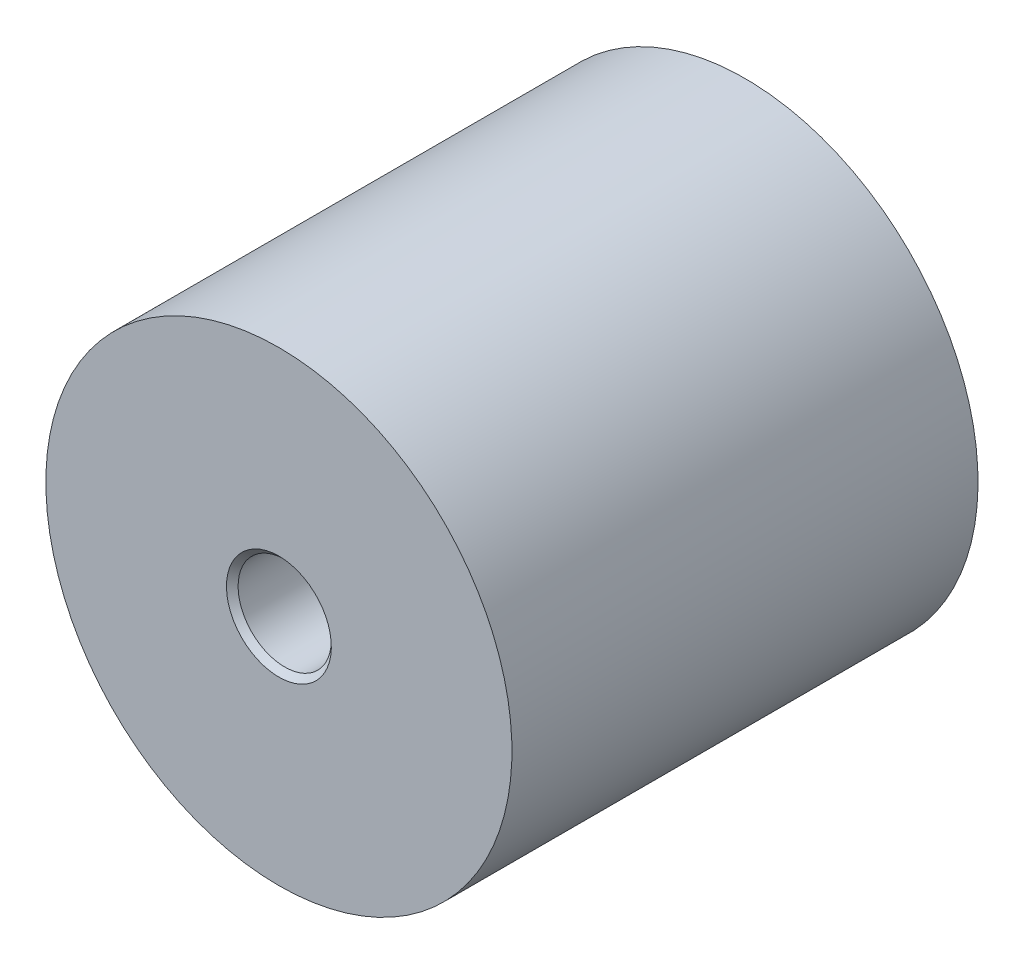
ISO-10303-21;
HEADER;
FILE_DESCRIPTION(('STEP AP214'),'2;1');
FILE_NAME('part.step','',(''),(''),'','','');
FILE_SCHEMA(('AUTOMOTIVE_DESIGN { 1 0 10303 214 1 1 1 1 }'));
ENDSEC;
DATA;
#1=APPLICATION_CONTEXT('core data for automotive mechanical design processes');
#2=APPLICATION_PROTOCOL_DEFINITION('international standard','automotive_design',2000,#1);
#3=PRODUCT_CONTEXT('',#1,'mechanical');
#4=PRODUCT('Part','Part','',(#3));
#5=PRODUCT_RELATED_PRODUCT_CATEGORY('part','',(#4));
#6=PRODUCT_DEFINITION_FORMATION('','',#4);
#7=PRODUCT_DEFINITION_CONTEXT('part definition',#1,'design');
#8=PRODUCT_DEFINITION('design','',#6,#7);
#9=PRODUCT_DEFINITION_SHAPE('','',#8);
#10=(LENGTH_UNIT() NAMED_UNIT(*) SI_UNIT(.MILLI.,.METRE.));
#11=(NAMED_UNIT(*) PLANE_ANGLE_UNIT() SI_UNIT($,.RADIAN.));
#12=(NAMED_UNIT(*) SI_UNIT($,.STERADIAN.) SOLID_ANGLE_UNIT());
#13=UNCERTAINTY_MEASURE_WITH_UNIT(LENGTH_MEASURE(1.E-05),#10,'distance_accuracy_value','');
#14=(GEOMETRIC_REPRESENTATION_CONTEXT(3) GLOBAL_UNCERTAINTY_ASSIGNED_CONTEXT((#13)) GLOBAL_UNIT_ASSIGNED_CONTEXT((#10,
#11,#12)) REPRESENTATION_CONTEXT('',''));
#15=CARTESIAN_POINT('',(0.,0.,0.));
#16=DIRECTION('',(0.,0.,1.));
#17=DIRECTION('',(1.,0.,0.));
#18=AXIS2_PLACEMENT_3D('',#15,#16,#17);
#19=CARTESIAN_POINT('',(0.,0.,1.));
#20=DIRECTION('',(0.,0.,1.));
#21=DIRECTION('',(0.,-1.,0.));
#22=AXIS2_PLACEMENT_3D('',#19,#20,#21);
#23=CYLINDRICAL_SURFACE('',#22,20.);
#24=CARTESIAN_POINT('',(0.,0.,0.));
#25=DIRECTION('',(0.,0.,1.));
#26=DIRECTION('',(0.,-1.,0.));
#27=AXIS2_PLACEMENT_3D('',#24,#25,#26);
#28=CIRCLE('',#27,20.);
#29=CARTESIAN_POINT('',(0.,-20.,0.));
#30=VERTEX_POINT('',#29);
#31=EDGE_CURVE('E23',#30,#30,#28,.T.);
#32=ORIENTED_EDGE('',*,*,#31,.T.);
#33=EDGE_LOOP('',(#32));
#34=FACE_BOUND('',#33,.T.);
#35=CARTESIAN_POINT('',(0.,0.,40.));
#36=DIRECTION('',(0.,0.,-1.));
#37=DIRECTION('',(0.,1.,0.));
#38=AXIS2_PLACEMENT_3D('',#35,#36,#37);
#39=CIRCLE('',#38,20.);
#40=CARTESIAN_POINT('',(0.,20.,40.));
#41=VERTEX_POINT('',#40);
#42=EDGE_CURVE('E32',#41,#41,#39,.T.);
#43=ORIENTED_EDGE('',*,*,#42,.T.);
#44=EDGE_LOOP('',(#43));
#45=FACE_BOUND('',#44,.T.);
#46=ADVANCED_FACE('F12',(#34,#45),#23,.T.);
#47=CARTESIAN_POINT('',(20.,0.,0.));
#48=DIRECTION('',(0.,0.,-1.));
#49=DIRECTION('',(0.,1.,0.));
#50=AXIS2_PLACEMENT_3D('',#47,#48,#49);
#51=PLANE('',#50);
#52=CARTESIAN_POINT('',(0.,0.,0.));
#53=DIRECTION('',(0.,0.,-1.));
#54=DIRECTION('',(0.,1.,0.));
#55=AXIS2_PLACEMENT_3D('',#52,#53,#54);
#56=CIRCLE('',#55,4.5);
#57=CARTESIAN_POINT('',(0.,4.5,0.));
#58=VERTEX_POINT('',#57);
#59=EDGE_CURVE('E8',#58,#58,#56,.F.);
#60=ORIENTED_EDGE('',*,*,#59,.T.);
#61=EDGE_LOOP('',(#60));
#62=FACE_BOUND('',#61,.T.);
#63=ORIENTED_EDGE('',*,*,#31,.F.);
#64=EDGE_LOOP('',(#63));
#65=FACE_BOUND('',#64,.T.);
#66=ADVANCED_FACE('F58',(#62,#65),#51,.T.);
#67=CARTESIAN_POINT('',(0.,0.,0.));
#68=DIRECTION('',(0.,0.,1.));
#69=DIRECTION('',(0.,-1.,0.));
#70=AXIS2_PLACEMENT_3D('',#67,#68,#69);
#71=CYLINDRICAL_SURFACE('',#70,4.);
#72=CARTESIAN_POINT('',(0.,0.,0.50000000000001));
#73=DIRECTION('',(0.,0.,-1.));
#74=DIRECTION('',(0.,1.,0.));
#75=AXIS2_PLACEMENT_3D('',#72,#73,#74);
#76=CIRCLE('',#75,4.);
#77=CARTESIAN_POINT('',(0.,4.,0.50000000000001));
#78=VERTEX_POINT('',#77);
#79=EDGE_CURVE('E19',#78,#78,#76,.T.);
#80=ORIENTED_EDGE('',*,*,#79,.T.);
#81=EDGE_LOOP('',(#80));
#82=FACE_BOUND('',#81,.T.);
#83=CARTESIAN_POINT('',(0.,0.,8.));
#84=DIRECTION('',(0.,0.,-1.));
#85=DIRECTION('',(0.,1.,0.));
#86=AXIS2_PLACEMENT_3D('',#83,#84,#85);
#87=CIRCLE('',#86,4.);
#88=CARTESIAN_POINT('',(0.,4.,8.));
#89=VERTEX_POINT('',#88);
#90=EDGE_CURVE('E27',#89,#89,#87,.T.);
#91=ORIENTED_EDGE('',*,*,#90,.F.);
#92=EDGE_LOOP('',(#91));
#93=FACE_BOUND('',#92,.T.);
#94=ADVANCED_FACE('F63',(#82,#93),#71,.F.);
#95=CARTESIAN_POINT('',(0.,0.,8.));
#96=DIRECTION('',(0.,0.,-1.));
#97=DIRECTION('',(0.,1.,0.));
#98=AXIS2_PLACEMENT_3D('',#95,#96,#97);
#99=PLANE('',#98);
#100=ORIENTED_EDGE('',*,*,#90,.T.);
#101=EDGE_LOOP('',(#100));
#102=FACE_BOUND('',#101,.T.);
#103=ADVANCED_FACE('F69',(#102),#99,.T.);
#104=CARTESIAN_POINT('',(0.,0.,0.50000000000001));
#105=DIRECTION('',(0.,0.,-1.));
#106=DIRECTION('',(0.,1.,0.));
#107=AXIS2_PLACEMENT_3D('',#104,#105,#106);
#108=CONICAL_SURFACE('',#107,4.,0.785398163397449);
#109=ORIENTED_EDGE('',*,*,#59,.F.);
#110=EDGE_LOOP('',(#109));
#111=FACE_BOUND('',#110,.T.);
#112=ORIENTED_EDGE('',*,*,#79,.F.);
#113=EDGE_LOOP('',(#112));
#114=FACE_BOUND('',#113,.T.);
#115=ADVANCED_FACE('F14',(#111,#114),#108,.F.);
#116=CARTESIAN_POINT('',(20.,0.,40.));
#117=DIRECTION('',(0.,0.,1.));
#118=DIRECTION('',(0.,-1.,0.));
#119=AXIS2_PLACEMENT_3D('',#116,#117,#118);
#120=PLANE('',#119);
#121=CARTESIAN_POINT('',(0.,0.,40.));
#122=DIRECTION('',(0.,0.,-1.));
#123=DIRECTION('',(0.,1.,0.));
#124=AXIS2_PLACEMENT_3D('',#121,#122,#123);
#125=CIRCLE('',#124,4.5);
#126=CARTESIAN_POINT('',(0.,4.5,40.));
#127=VERTEX_POINT('',#126);
#128=EDGE_CURVE('E35',#127,#127,#125,.T.);
#129=ORIENTED_EDGE('',*,*,#128,.T.);
#130=EDGE_LOOP('',(#129));
#131=FACE_BOUND('',#130,.T.);
#132=ORIENTED_EDGE('',*,*,#42,.F.);
#133=EDGE_LOOP('',(#132));
#134=FACE_BOUND('',#133,.T.);
#135=ADVANCED_FACE('F73',(#131,#134),#120,.T.);
#136=CARTESIAN_POINT('',(0.,0.,40.));
#137=DIRECTION('',(0.,0.,1.));
#138=DIRECTION('',(0.,-1.,0.));
#139=AXIS2_PLACEMENT_3D('',#136,#137,#138);
#140=CONICAL_SURFACE('',#139,4.5,0.785398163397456);
#141=CARTESIAN_POINT('',(0.,0.,39.5));
#142=DIRECTION('',(0.,0.,-1.));
#143=DIRECTION('',(0.,1.,0.));
#144=AXIS2_PLACEMENT_3D('',#141,#142,#143);
#145=CIRCLE('',#144,4.);
#146=CARTESIAN_POINT('',(0.,4.,39.5));
#147=VERTEX_POINT('',#146);
#148=EDGE_CURVE('E38',#147,#147,#145,.T.);
#149=ORIENTED_EDGE('',*,*,#148,.T.);
#150=EDGE_LOOP('',(#149));
#151=FACE_BOUND('',#150,.T.);
#152=ORIENTED_EDGE('',*,*,#128,.F.);
#153=EDGE_LOOP('',(#152));
#154=FACE_BOUND('',#153,.T.);
#155=ADVANCED_FACE('F55',(#151,#154),#140,.F.);
#156=CARTESIAN_POINT('',(0.,0.,0.));
#157=DIRECTION('',(0.,0.,-1.));
#158=DIRECTION('',(0.,1.,0.));
#159=AXIS2_PLACEMENT_3D('',#156,#157,#158);
#160=CYLINDRICAL_SURFACE('',#159,4.);
#161=CARTESIAN_POINT('',(0.,0.,32.));
#162=DIRECTION('',(0.,0.,-1.));
#163=DIRECTION('',(0.,1.,0.));
#164=AXIS2_PLACEMENT_3D('',#161,#162,#163);
#165=CIRCLE('',#164,4.);
#166=CARTESIAN_POINT('',(0.,4.,32.));
#167=VERTEX_POINT('',#166);
#168=EDGE_CURVE('E41',#167,#167,#165,.T.);
#169=ORIENTED_EDGE('',*,*,#168,.T.);
#170=EDGE_LOOP('',(#169));
#171=FACE_BOUND('',#170,.T.);
#172=ORIENTED_EDGE('',*,*,#148,.F.);
#173=EDGE_LOOP('',(#172));
#174=FACE_BOUND('',#173,.T.);
#175=ADVANCED_FACE('F45',(#171,#174),#160,.F.);
#176=CARTESIAN_POINT('',(4.,0.,32.));
#177=DIRECTION('',(0.,0.,1.));
#178=DIRECTION('',(0.,-1.,0.));
#179=AXIS2_PLACEMENT_3D('',#176,#177,#178);
#180=PLANE('',#179);
#181=ORIENTED_EDGE('',*,*,#168,.F.);
#182=EDGE_LOOP('',(#181));
#183=FACE_BOUND('',#182,.T.);
#184=ADVANCED_FACE('F48',(#183),#180,.T.);
#185=CLOSED_SHELL('',(#46,#66,#94,#103,#115,#135,#155,#175,#184));
#186=MANIFOLD_SOLID_BREP('B1',#185);
#187=ADVANCED_BREP_SHAPE_REPRESENTATION('',(#18,#186),#14);
#188=SHAPE_DEFINITION_REPRESENTATION(#9,#187);
ENDSEC;
END-ISO-10303-21;
